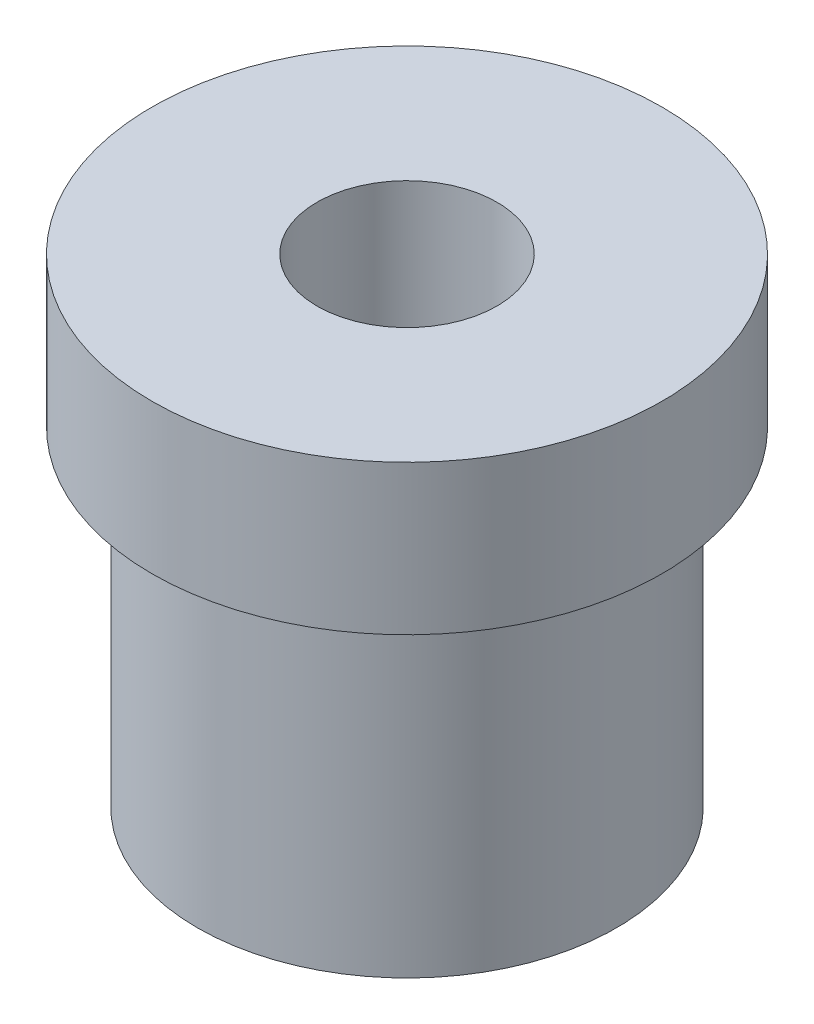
from build123d import *

# Parameters (mm, degrees)
SKETCH1_R           = 5.55625
BASE_EXTRUDE_DEPTH  = 12.7
SKETCH2_R           = 6.76275
BOSS_EXTRUDE1_DEPTH = 3.9624
SKETCH3_R           = 2.3876
CUT_EXTRUDE1_DEPTH  = 16.898414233


with BuildPart() as part:
    # Sketch1 → Base-Extrude (new body)
    with BuildSketch(Plane(origin=(0, 0, 0), x_dir=(1, 0, 0), z_dir=(0, 1, 0))):
        with Locations(Location((0, 0, 0), (0, 0, 270))):
            Circle(SKETCH1_R)
    extrude(amount=-BASE_EXTRUDE_DEPTH)

    # Sketch2 → Boss-Extrude1 (add)
    with BuildSketch(Plane(origin=(0, 0, 0), x_dir=(-1, 0, 0), z_dir=(0, 1, 0))):
        with Locations(Location((0, 0, 0), (0, 0, 90))):
            Circle(SKETCH2_R)
    extrude(amount=-BOSS_EXTRUDE1_DEPTH)

    # Sketch3 → Cut-Extrude1 (cut, through all)
    with BuildSketch(Plane(origin=(0, 0, 0), x_dir=(-1, 0, 0), z_dir=(0, 1, 0))):
        with Locations(Location((0, 0, 0), (0, 0, 90))):
            Circle(SKETCH3_R)
    extrude(amount=-CUT_EXTRUDE1_DEPTH, mode=Mode.SUBTRACT)


solid = part.part
